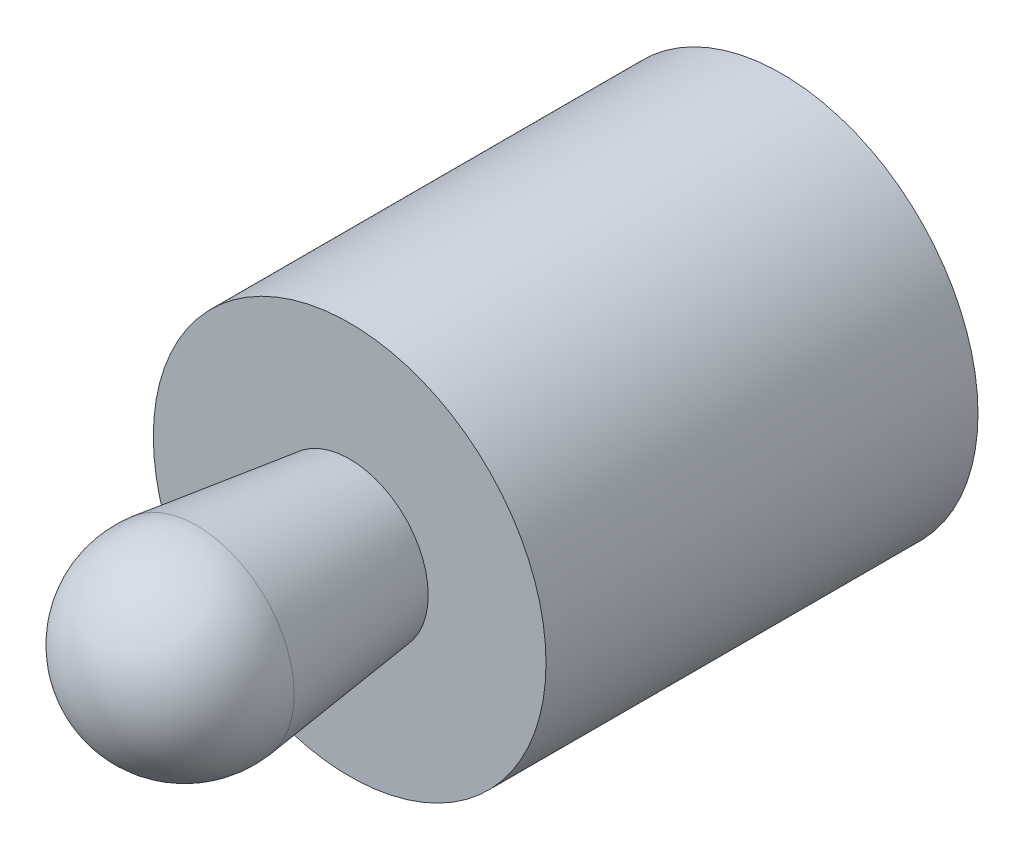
ISO-10303-21;
HEADER;
FILE_DESCRIPTION(('STEP AP214'),'2;1');
FILE_NAME('part.step','',(''),(''),'','','');
FILE_SCHEMA(('AUTOMOTIVE_DESIGN { 1 0 10303 214 1 1 1 1 }'));
ENDSEC;
DATA;
#1=APPLICATION_CONTEXT('core data for automotive mechanical design processes');
#2=APPLICATION_PROTOCOL_DEFINITION('international standard','automotive_design',2000,#1);
#3=PRODUCT_CONTEXT('',#1,'mechanical');
#4=PRODUCT('Part','Part','',(#3));
#5=PRODUCT_RELATED_PRODUCT_CATEGORY('part','',(#4));
#6=PRODUCT_DEFINITION_FORMATION('','',#4);
#7=PRODUCT_DEFINITION_CONTEXT('part definition',#1,'design');
#8=PRODUCT_DEFINITION('design','',#6,#7);
#9=PRODUCT_DEFINITION_SHAPE('','',#8);
#10=(LENGTH_UNIT() NAMED_UNIT(*) SI_UNIT(.MILLI.,.METRE.));
#11=(NAMED_UNIT(*) PLANE_ANGLE_UNIT() SI_UNIT($,.RADIAN.));
#12=(NAMED_UNIT(*) SI_UNIT($,.STERADIAN.) SOLID_ANGLE_UNIT());
#13=UNCERTAINTY_MEASURE_WITH_UNIT(LENGTH_MEASURE(1.E-05),#10,'distance_accuracy_value','');
#14=(GEOMETRIC_REPRESENTATION_CONTEXT(3) GLOBAL_UNCERTAINTY_ASSIGNED_CONTEXT((#13)) GLOBAL_UNIT_ASSIGNED_CONTEXT((#10,
#11,#12)) REPRESENTATION_CONTEXT('',''));
#15=CARTESIAN_POINT('',(0.,0.,0.));
#16=DIRECTION('',(0.,0.,1.));
#17=DIRECTION('',(1.,0.,0.));
#18=AXIS2_PLACEMENT_3D('',#15,#16,#17);
#19=CARTESIAN_POINT('',(0.,0.,0.));
#20=DIRECTION('',(0.,0.,1.));
#21=DIRECTION('',(1.,0.,0.));
#22=AXIS2_PLACEMENT_3D('',#19,#20,#21);
#23=PLANE('',#22);
#24=CARTESIAN_POINT('',(0.,0.,0.));
#25=DIRECTION('',(0.,0.,1.));
#26=DIRECTION('',(1.,0.,0.));
#27=AXIS2_PLACEMENT_3D('',#24,#25,#26);
#28=CIRCLE('',#27,5.);
#29=CARTESIAN_POINT('',(5.,0.,0.));
#30=VERTEX_POINT('',#29);
#31=EDGE_CURVE('E8',#30,#30,#28,.T.);
#32=ORIENTED_EDGE('',*,*,#31,.F.);
#33=EDGE_LOOP('',(#32));
#34=FACE_BOUND('',#33,.T.);
#35=ADVANCED_FACE('F12',(#34),#23,.F.);
#36=CARTESIAN_POINT('',(0.,0.,20.));
#37=DIRECTION('',(0.,0.,1.));
#38=DIRECTION('',(1.,0.,0.));
#39=AXIS2_PLACEMENT_3D('',#36,#37,#38);
#40=CYLINDRICAL_SURFACE('',#39,5.);
#41=CARTESIAN_POINT('',(0.,0.,11.));
#42=DIRECTION('',(0.,0.,1.));
#43=DIRECTION('',(1.,0.,0.));
#44=AXIS2_PLACEMENT_3D('',#41,#42,#43);
#45=CIRCLE('',#44,5.);
#46=CARTESIAN_POINT('',(5.,0.,11.));
#47=VERTEX_POINT('',#46);
#48=EDGE_CURVE('E18',#47,#47,#45,.T.);
#49=ORIENTED_EDGE('',*,*,#48,.F.);
#50=EDGE_LOOP('',(#49));
#51=FACE_BOUND('',#50,.T.);
#52=ORIENTED_EDGE('',*,*,#31,.T.);
#53=EDGE_LOOP('',(#52));
#54=FACE_BOUND('',#53,.T.);
#55=ADVANCED_FACE('F45',(#51,#54),#40,.T.);
#56=CARTESIAN_POINT('',(-2.,0.,11.));
#57=DIRECTION('',(0.,0.,1.));
#58=DIRECTION('',(1.,0.,0.));
#59=AXIS2_PLACEMENT_3D('',#56,#57,#58);
#60=PLANE('',#59);
#61=ORIENTED_EDGE('',*,*,#48,.T.);
#62=EDGE_LOOP('',(#61));
#63=FACE_BOUND('',#62,.T.);
#64=CARTESIAN_POINT('',(0.,0.,11.));
#65=DIRECTION('',(0.,0.,1.));
#66=DIRECTION('',(1.,0.,0.));
#67=AXIS2_PLACEMENT_3D('',#64,#65,#66);
#68=CIRCLE('',#67,2.);
#69=CARTESIAN_POINT('',(2.,0.,11.));
#70=VERTEX_POINT('',#69);
#71=EDGE_CURVE('E22',#70,#70,#68,.T.);
#72=ORIENTED_EDGE('',*,*,#71,.F.);
#73=EDGE_LOOP('',(#72));
#74=FACE_BOUND('',#73,.T.);
#75=ADVANCED_FACE('F36',(#63,#74),#60,.T.);
#76=CARTESIAN_POINT('',(0.,0.,14.8933939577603));
#77=DIRECTION('',(0.,0.,1.));
#78=DIRECTION('',(1.,0.,0.));
#79=AXIS2_PLACEMENT_3D('',#76,#77,#78);
#80=CONICAL_SURFACE('',#79,2.48112731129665,0.122951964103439);
#81=ORIENTED_EDGE('',*,*,#71,.T.);
#82=EDGE_LOOP('',(#81));
#83=FACE_BOUND('',#82,.T.);
#84=CARTESIAN_POINT('',(0.,0.,14.8933939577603));
#85=DIRECTION('',(0.,0.,1.));
#86=DIRECTION('',(1.,0.,0.));
#87=AXIS2_PLACEMENT_3D('',#84,#85,#86);
#88=CIRCLE('',#87,2.48112731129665);
#89=CARTESIAN_POINT('',(2.48112731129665,0.,14.8933939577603));
#90=VERTEX_POINT('',#89);
#91=EDGE_CURVE('E26',#90,#90,#88,.T.);
#92=ORIENTED_EDGE('',*,*,#91,.F.);
#93=EDGE_LOOP('',(#92));
#94=FACE_BOUND('',#93,.T.);
#95=ADVANCED_FACE('F34',(#83,#94),#80,.T.);
#96=CARTESIAN_POINT('',(0.,0.,15.2));
#97=DIRECTION('',(0.,0.,1.));
#98=DIRECTION('',(1.,0.,0.));
#99=AXIS2_PLACEMENT_3D('',#96,#97,#98);
#100=SPHERICAL_SURFACE('',#99,2.5);
#101=ORIENTED_EDGE('',*,*,#91,.T.);
#102=EDGE_LOOP('',(#101));
#103=FACE_BOUND('',#102,.T.);
#104=ADVANCED_FACE('F32',(#103),#100,.T.);
#105=CLOSED_SHELL('',(#35,#55,#75,#95,#104));
#106=MANIFOLD_SOLID_BREP('B1',#105);
#107=ADVANCED_BREP_SHAPE_REPRESENTATION('',(#18,#106),#14);
#108=SHAPE_DEFINITION_REPRESENTATION(#9,#107);
ENDSEC;
END-ISO-10303-21;
